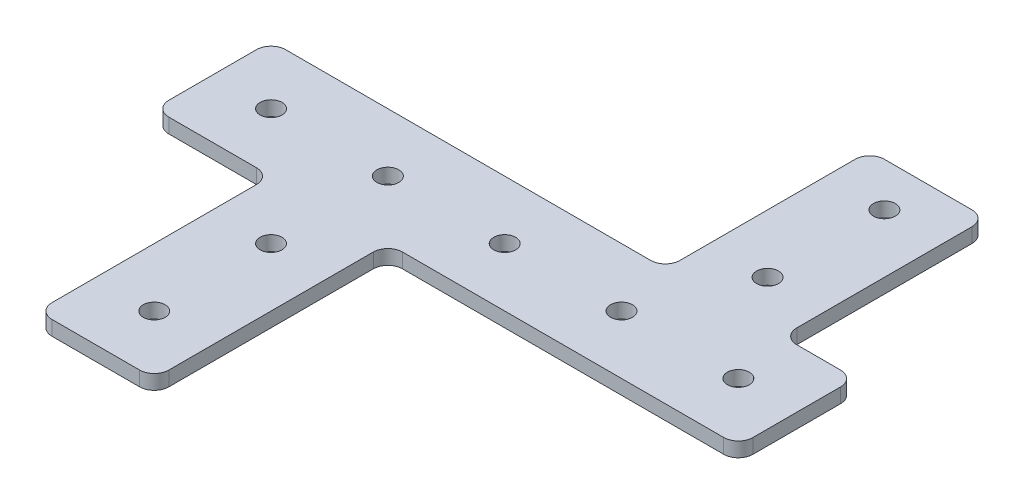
from build123d import *

# Parameters (mm, degrees)
SKETCH1_R           = 2.38125
BOSS_EXTRUDE1_DEPTH = 3.175
FILLET1_R           = 3.175


with BuildPart() as part:
    # Sketch1 → Boss-Extrude1 (new body)
    with BuildSketch(Plane(origin=(0, 0, 0), x_dir=(1, 0, 0), z_dir=(0, 1, 0))):
        Polygon((0, -44.45), (0, 0), (25.4, 0), (25.4, -44.45), (41.275, -44.45), (41.275, -69.85), (-34.925, -69.85), (-34.925, -120.65), (-60.325, -120.65), (-60.325, -69.85), (-85.725, -69.85), (-85.725, -44.45), (-34.925, -44.45), align=None)
        with Locations(Location((-22.225, -57.15, 0), (0, 0, 270))):
            Circle(SKETCH1_R, mode=Mode.SUBTRACT)
        with Locations(Location((3.175, -57.15, 0), (0, 0, 270))):
            Circle(SKETCH1_R, mode=Mode.SUBTRACT)
        with Locations(Location((28.575, -57.15, 0), (0, 0, 270))):
            Circle(SKETCH1_R, mode=Mode.SUBTRACT)
        with Locations(Location((-73.025, -57.15, 0), (0, 0, 270))):
            Circle(SKETCH1_R, mode=Mode.SUBTRACT)
        with Locations(Location((12.7, -9.525, 0), (0, 0, 270))):
            Circle(SKETCH1_R, mode=Mode.SUBTRACT)
        with Locations(Location((12.7, -34.925, 0), (0, 0, 270))):
            Circle(SKETCH1_R, mode=Mode.SUBTRACT)
        with Locations(Location((-47.625, -57.15, 0), (0, 0, 270))):
            Circle(SKETCH1_R, mode=Mode.SUBTRACT)
        with Locations(Location((-47.625, -82.55, 0), (0, 0, 270))):
            Circle(SKETCH1_R, mode=Mode.SUBTRACT)
        with Locations(Location((-47.625, -107.95, 0), (0, 0, 270))):
            Circle(SKETCH1_R, mode=Mode.SUBTRACT)
    extrude(amount=BOSS_EXTRUDE1_DEPTH)

    # Fillet1
    fillet1_edges = [part.edges().sort_by_distance(p)[0] for p in [
        (0, 1.5875, 44.45),
        (0, 1.5875, 0),
        (25.4, 1.5875, 0),
        (25.4, 1.5875, 44.45),
        (41.275, 1.5875, 44.45),
        (41.275, 1.5875, 69.85),
        (-34.925, 1.5875, 69.85),
        (-34.925, 1.5875, 120.65),
        (-60.325, 1.5875, 120.65),
        (-60.325, 1.5875, 69.85),
        (-85.725, 1.5875, 69.85),
        (-85.725, 1.5875, 44.45),
    ]]
    fillet(fillet1_edges, radius=FILLET1_R)


solid = part.part
